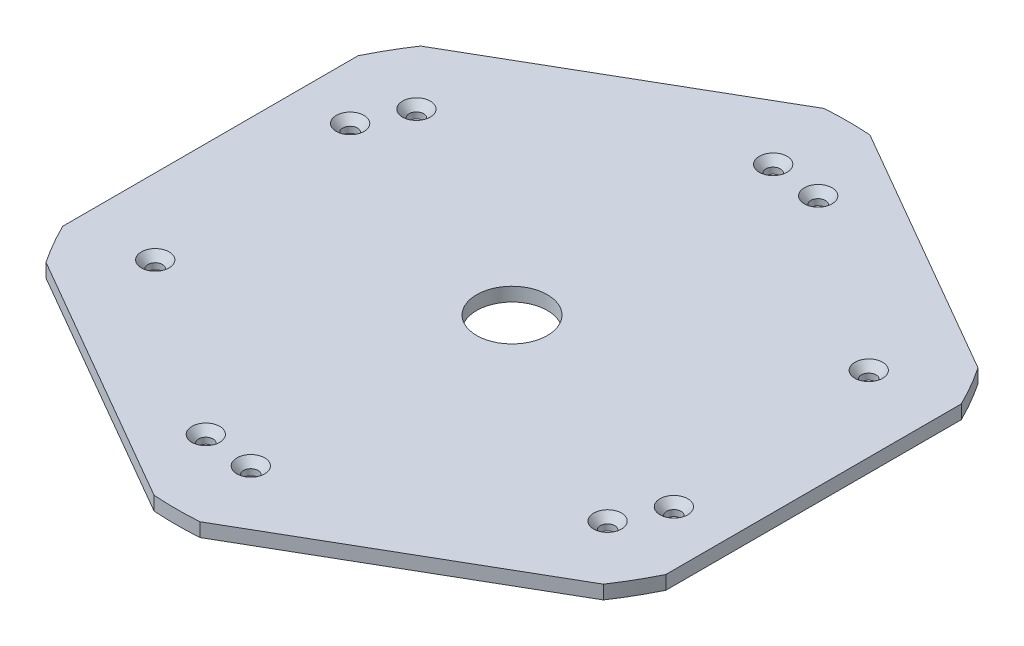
ISO-10303-21;
HEADER;
FILE_DESCRIPTION(('STEP AP214'),'2;1');
FILE_NAME('part.step','',(''),(''),'','','');
FILE_SCHEMA(('AUTOMOTIVE_DESIGN { 1 0 10303 214 1 1 1 1 }'));
ENDSEC;
DATA;
#1=APPLICATION_CONTEXT('core data for automotive mechanical design processes');
#2=APPLICATION_PROTOCOL_DEFINITION('international standard','automotive_design',2000,#1);
#3=PRODUCT_CONTEXT('',#1,'mechanical');
#4=PRODUCT('Part','Part','',(#3));
#5=PRODUCT_RELATED_PRODUCT_CATEGORY('part','',(#4));
#6=PRODUCT_DEFINITION_FORMATION('','',#4);
#7=PRODUCT_DEFINITION_CONTEXT('part definition',#1,'design');
#8=PRODUCT_DEFINITION('design','',#6,#7);
#9=PRODUCT_DEFINITION_SHAPE('','',#8);
#10=(LENGTH_UNIT() NAMED_UNIT(*) SI_UNIT(.MILLI.,.METRE.));
#11=(NAMED_UNIT(*) PLANE_ANGLE_UNIT() SI_UNIT($,.RADIAN.));
#12=(NAMED_UNIT(*) SI_UNIT($,.STERADIAN.) SOLID_ANGLE_UNIT());
#13=UNCERTAINTY_MEASURE_WITH_UNIT(LENGTH_MEASURE(1.E-05),#10,'distance_accuracy_value','');
#14=(GEOMETRIC_REPRESENTATION_CONTEXT(3) GLOBAL_UNCERTAINTY_ASSIGNED_CONTEXT((#13)) GLOBAL_UNIT_ASSIGNED_CONTEXT((#10,
#11,#12)) REPRESENTATION_CONTEXT('',''));
#15=CARTESIAN_POINT('',(0.,0.,0.));
#16=DIRECTION('',(0.,0.,1.));
#17=DIRECTION('',(1.,0.,0.));
#18=AXIS2_PLACEMENT_3D('',#15,#16,#17);
#19=CARTESIAN_POINT('',(0.,6.35,0.));
#20=DIRECTION('',(0.,-1.,0.));
#21=DIRECTION('',(0.,0.,-1.));
#22=AXIS2_PLACEMENT_3D('',#19,#20,#21);
#23=CYLINDRICAL_SURFACE('',#22,155.575);
#24=CARTESIAN_POINT('',(0.,6.35,0.));
#25=DIRECTION('',(0.,1.,0.));
#26=DIRECTION('',(0.,0.,1.));
#27=AXIS2_PLACEMENT_3D('',#24,#25,#26);
#28=CIRCLE('',#27,155.575);
#29=CARTESIAN_POINT('',(139.718923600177,6.35,-68.4266250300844));
#30=VERTEX_POINT('',#29);
#31=CARTESIAN_POINT('',(129.118657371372,6.35,-86.7868247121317));
#32=VERTEX_POINT('',#31);
#33=EDGE_CURVE('E347',#30,#32,#28,.T.);
#34=ORIENTED_EDGE('',*,*,#33,.F.);
#35=DIRECTION('',(0.,-1.,0.));
#36=VECTOR('',#35,1.);
#37=CARTESIAN_POINT('',(139.718923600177,6.35,-68.4266250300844));
#38=LINE('',#37,#36);
#39=CARTESIAN_POINT('',(139.718923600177,0.,-68.4266250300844));
#40=VERTEX_POINT('',#39);
#41=EDGE_CURVE('E247',#30,#40,#38,.T.);
#42=ORIENTED_EDGE('',*,*,#41,.T.);
#43=CARTESIAN_POINT('',(0.,0.,0.));
#44=DIRECTION('',(0.,1.,0.));
#45=DIRECTION('',(0.,0.,1.));
#46=AXIS2_PLACEMENT_3D('',#43,#44,#45);
#47=CIRCLE('',#46,155.575);
#48=CARTESIAN_POINT('',(129.118657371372,0.,-86.7868247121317));
#49=VERTEX_POINT('',#48);
#50=EDGE_CURVE('E193',#40,#49,#47,.T.);
#51=ORIENTED_EDGE('',*,*,#50,.T.);
#52=DIRECTION('',(0.,-1.,0.));
#53=VECTOR('',#52,1.);
#54=CARTESIAN_POINT('',(129.118657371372,6.35,-86.7868247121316));
#55=LINE('',#54,#53);
#56=EDGE_CURVE('E240',#49,#32,#55,.F.);
#57=ORIENTED_EDGE('',*,*,#56,.T.);
#58=EDGE_LOOP('',(#34,#42,#51,#57));
#59=FACE_BOUND('',#58,.T.);
#60=ADVANCED_FACE('F52',(#59),#23,.T.);
#61=CARTESIAN_POINT('',(10.6002662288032,6.35,-155.213449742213));
#62=VERTEX_POINT('',#61);
#63=CARTESIAN_POINT('',(-10.6002662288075,6.35,-155.213449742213));
#64=VERTEX_POINT('',#63);
#65=EDGE_CURVE('E244',#62,#64,#28,.T.);
#66=ORIENTED_EDGE('',*,*,#65,.F.);
#67=DIRECTION('',(0.,-1.,0.));
#68=VECTOR('',#67,1.);
#69=CARTESIAN_POINT('',(10.6002662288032,6.35,-155.213449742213));
#70=LINE('',#69,#68);
#71=CARTESIAN_POINT('',(10.6002662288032,0.,-155.213449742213));
#72=VERTEX_POINT('',#71);
#73=EDGE_CURVE('E238',#62,#72,#70,.T.);
#74=ORIENTED_EDGE('',*,*,#73,.T.);
#75=CARTESIAN_POINT('',(-10.6002662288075,0.,-155.213449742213));
#76=VERTEX_POINT('',#75);
#77=EDGE_CURVE('E204',#72,#76,#47,.T.);
#78=ORIENTED_EDGE('',*,*,#77,.T.);
#79=DIRECTION('',(0.,-1.,0.));
#80=VECTOR('',#79,1.);
#81=CARTESIAN_POINT('',(-10.6002662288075,6.35,-155.213449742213));
#82=LINE('',#81,#80);
#83=EDGE_CURVE('E376',#76,#64,#82,.F.);
#84=ORIENTED_EDGE('',*,*,#83,.T.);
#85=EDGE_LOOP('',(#66,#74,#78,#84));
#86=FACE_BOUND('',#85,.T.);
#87=ADVANCED_FACE('F242',(#86),#23,.T.);
#88=CARTESIAN_POINT('',(-129.118657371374,6.35,-86.7868247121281));
#89=VERTEX_POINT('',#88);
#90=CARTESIAN_POINT('',(-139.718923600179,6.35,-68.4266250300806));
#91=VERTEX_POINT('',#90);
#92=EDGE_CURVE('E353',#89,#91,#28,.T.);
#93=ORIENTED_EDGE('',*,*,#92,.F.);
#94=DIRECTION('',(0.,-1.,0.));
#95=VECTOR('',#94,1.);
#96=CARTESIAN_POINT('',(-129.118657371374,6.35,-86.7868247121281));
#97=LINE('',#96,#95);
#98=CARTESIAN_POINT('',(-129.118657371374,0.,-86.7868247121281));
#99=VERTEX_POINT('',#98);
#100=EDGE_CURVE('E223',#89,#99,#97,.T.);
#101=ORIENTED_EDGE('',*,*,#100,.T.);
#102=CARTESIAN_POINT('',(-139.718923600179,0.,-68.4266250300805));
#103=VERTEX_POINT('',#102);
#104=EDGE_CURVE('E186',#99,#103,#47,.T.);
#105=ORIENTED_EDGE('',*,*,#104,.T.);
#106=DIRECTION('',(0.,-1.,0.));
#107=VECTOR('',#106,1.);
#108=CARTESIAN_POINT('',(-139.718923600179,6.35,-68.4266250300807));
#109=LINE('',#108,#107);
#110=EDGE_CURVE('E79',#103,#91,#109,.F.);
#111=ORIENTED_EDGE('',*,*,#110,.T.);
#112=EDGE_LOOP('',(#93,#101,#105,#111));
#113=FACE_BOUND('',#112,.T.);
#114=ADVANCED_FACE('F221',(#113),#23,.T.);
#115=CARTESIAN_POINT('',(-139.718923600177,6.35,68.4266250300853));
#116=VERTEX_POINT('',#115);
#117=CARTESIAN_POINT('',(-129.118657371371,6.35,86.7868247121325));
#118=VERTEX_POINT('',#117);
#119=EDGE_CURVE('E200',#116,#118,#28,.T.);
#120=ORIENTED_EDGE('',*,*,#119,.F.);
#121=DIRECTION('',(0.,-1.,0.));
#122=VECTOR('',#121,1.);
#123=CARTESIAN_POINT('',(-139.718923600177,6.35,68.4266250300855));
#124=LINE('',#123,#122);
#125=CARTESIAN_POINT('',(-139.718923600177,0.,68.4266250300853));
#126=VERTEX_POINT('',#125);
#127=EDGE_CURVE('E366',#116,#126,#124,.T.);
#128=ORIENTED_EDGE('',*,*,#127,.T.);
#129=CARTESIAN_POINT('',(-129.118657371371,0.,86.7868247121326));
#130=VERTEX_POINT('',#129);
#131=EDGE_CURVE('E180',#126,#130,#47,.T.);
#132=ORIENTED_EDGE('',*,*,#131,.T.);
#133=DIRECTION('',(0.,-1.,0.));
#134=VECTOR('',#133,1.);
#135=CARTESIAN_POINT('',(-129.118657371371,6.35,86.7868247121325));
#136=LINE('',#135,#134);
#137=EDGE_CURVE('E68',#130,#118,#136,.F.);
#138=ORIENTED_EDGE('',*,*,#137,.T.);
#139=EDGE_LOOP('',(#120,#128,#132,#138));
#140=FACE_BOUND('',#139,.T.);
#141=ADVANCED_FACE('F365',(#140),#23,.T.);
#142=CARTESIAN_POINT('',(-10.6002662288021,6.35,155.213449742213));
#143=VERTEX_POINT('',#142);
#144=CARTESIAN_POINT('',(10.6002662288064,6.35,155.213449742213));
#145=VERTEX_POINT('',#144);
#146=EDGE_CURVE('E172',#143,#145,#28,.T.);
#147=ORIENTED_EDGE('',*,*,#146,.F.);
#148=DIRECTION('',(0.,-1.,0.));
#149=VECTOR('',#148,1.);
#150=CARTESIAN_POINT('',(-10.6002662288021,6.35,155.213449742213));
#151=LINE('',#150,#149);
#152=CARTESIAN_POINT('',(-10.6002662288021,0.,155.213449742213));
#153=VERTEX_POINT('',#152);
#154=EDGE_CURVE('E156',#143,#153,#151,.T.);
#155=ORIENTED_EDGE('',*,*,#154,.T.);
#156=CARTESIAN_POINT('',(10.6002662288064,0.,155.213449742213));
#157=VERTEX_POINT('',#156);
#158=EDGE_CURVE('E170',#153,#157,#47,.T.);
#159=ORIENTED_EDGE('',*,*,#158,.T.);
#160=DIRECTION('',(0.,-1.,0.));
#161=VECTOR('',#160,1.);
#162=CARTESIAN_POINT('',(10.6002662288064,6.35,155.213449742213));
#163=LINE('',#162,#161);
#164=EDGE_CURVE('E257',#157,#145,#163,.F.);
#165=ORIENTED_EDGE('',*,*,#164,.T.);
#166=EDGE_LOOP('',(#147,#155,#159,#165));
#167=FACE_BOUND('',#166,.T.);
#168=ADVANCED_FACE('F168',(#167),#23,.T.);
#169=CARTESIAN_POINT('',(129.118657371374,0.,86.7868247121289));
#170=VERTEX_POINT('',#169);
#171=CARTESIAN_POINT('',(139.718923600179,0.,68.4266250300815));
#172=VERTEX_POINT('',#171);
#173=EDGE_CURVE('E183',#170,#172,#47,.T.);
#174=ORIENTED_EDGE('',*,*,#173,.T.);
#175=DIRECTION('',(0.,-1.,0.));
#176=VECTOR('',#175,1.);
#177=CARTESIAN_POINT('',(139.718923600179,6.35,68.4266250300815));
#178=LINE('',#177,#176);
#179=CARTESIAN_POINT('',(139.718923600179,6.35,68.4266250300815));
#180=VERTEX_POINT('',#179);
#181=EDGE_CURVE('E245',#172,#180,#178,.F.);
#182=ORIENTED_EDGE('',*,*,#181,.T.);
#183=CARTESIAN_POINT('',(129.118657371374,6.35,86.7868247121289));
#184=VERTEX_POINT('',#183);
#185=EDGE_CURVE('E201',#184,#180,#28,.T.);
#186=ORIENTED_EDGE('',*,*,#185,.F.);
#187=DIRECTION('',(0.,-1.,0.));
#188=VECTOR('',#187,1.);
#189=CARTESIAN_POINT('',(129.118657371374,6.35,86.786824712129));
#190=LINE('',#189,#188);
#191=EDGE_CURVE('E259',#184,#170,#190,.T.);
#192=ORIENTED_EDGE('',*,*,#191,.T.);
#193=EDGE_LOOP('',(#174,#182,#186,#192));
#194=FACE_BOUND('',#193,.T.);
#195=ADVANCED_FACE('F54',(#194),#23,.T.);
#196=CARTESIAN_POINT('',(0.,6.35,0.));
#197=DIRECTION('',(0.,1.,0.));
#198=DIRECTION('',(0.,0.,1.));
#199=AXIS2_PLACEMENT_3D('',#196,#197,#198);
#200=PLANE('',#199);
#201=CARTESIAN_POINT('',(-23.0735883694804,6.35,118.785372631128));
#202=DIRECTION('',(0.,1.,0.));
#203=DIRECTION('',(0.,0.,1.));
#204=AXIS2_PLACEMENT_3D('',#201,#202,#203);
#205=CIRCLE('',#204,6.4389);
#206=CARTESIAN_POINT('',(-23.0735883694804,6.35,125.224272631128));
#207=VERTEX_POINT('',#206);
#208=EDGE_CURVE('E425',#207,#207,#205,.T.);
#209=ORIENTED_EDGE('',*,*,#208,.F.);
#210=EDGE_LOOP('',(#209));
#211=FACE_BOUND('',#210,.T.);
#212=CARTESIAN_POINT('',(-114.407944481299,6.35,-39.4103726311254));
#213=DIRECTION('',(0.,1.,0.));
#214=DIRECTION('',(0.,0.,1.));
#215=AXIS2_PLACEMENT_3D('',#212,#213,#214);
#216=CIRCLE('',#215,6.4389);
#217=CARTESIAN_POINT('',(-114.407944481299,6.35,-32.9714726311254));
#218=VERTEX_POINT('',#217);
#219=EDGE_CURVE('E414',#218,#218,#216,.T.);
#220=ORIENTED_EDGE('',*,*,#219,.F.);
#221=EDGE_LOOP('',(#220));
#222=FACE_BOUND('',#221,.T.);
#223=CARTESIAN_POINT('',(114.407944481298,6.35,39.4103726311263));
#224=DIRECTION('',(0.,1.,0.));
#225=DIRECTION('',(0.,0.,1.));
#226=AXIS2_PLACEMENT_3D('',#223,#224,#225);
#227=CIRCLE('',#226,6.4389);
#228=CARTESIAN_POINT('',(114.407944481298,6.35,45.8492726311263));
#229=VERTEX_POINT('',#228);
#230=EDGE_CURVE('E402',#229,#229,#227,.T.);
#231=ORIENTED_EDGE('',*,*,#230,.F.);
#232=EDGE_LOOP('',(#231));
#233=FACE_BOUND('',#232,.T.);
#234=CARTESIAN_POINT('',(23.0735883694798,6.35,-118.785372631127));
#235=DIRECTION('',(0.,1.,0.));
#236=DIRECTION('',(0.,0.,1.));
#237=AXIS2_PLACEMENT_3D('',#234,#235,#236);
#238=CIRCLE('',#237,6.4389);
#239=CARTESIAN_POINT('',(23.0735883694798,6.35,-112.346472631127));
#240=VERTEX_POINT('',#239);
#241=EDGE_CURVE('E391',#240,#240,#238,.T.);
#242=ORIENTED_EDGE('',*,*,#241,.F.);
#243=EDGE_LOOP('',(#242));
#244=FACE_BOUND('',#243,.T.);
#245=DIRECTION('',(0.,0.,1.));
#246=VECTOR('',#245,1.);
#247=CARTESIAN_POINT('',(139.718923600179,6.35,116.509208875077));
#248=LINE('',#247,#246);
#249=EDGE_CURVE('E367',#30,#180,#248,.T.);
#250=ORIENTED_EDGE('',*,*,#249,.F.);
#251=ORIENTED_EDGE('',*,*,#33,.T.);
#252=DIRECTION('',(0.866025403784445,0.,0.499999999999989));
#253=VECTOR('',#252,1.);
#254=CARTESIAN_POINT('',(170.759396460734,6.35,-62.7455327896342));
#255=LINE('',#254,#253);
#256=EDGE_CURVE('E370',#62,#32,#255,.T.);
#257=ORIENTED_EDGE('',*,*,#256,.F.);
#258=ORIENTED_EDGE('',*,*,#65,.T.);
#259=DIRECTION('',(0.866025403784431,0.,-0.500000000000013));
#260=VECTOR('',#259,1.);
#261=CARTESIAN_POINT('',(31.0404728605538,6.35,-179.254741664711));
#262=LINE('',#261,#260);
#263=EDGE_CURVE('E379',#89,#64,#262,.T.);
#264=ORIENTED_EDGE('',*,*,#263,.F.);
#265=ORIENTED_EDGE('',*,*,#92,.T.);
#266=DIRECTION('',(0.,0.,-1.));
#267=VECTOR('',#266,1.);
#268=CARTESIAN_POINT('',(-139.71892360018,6.35,-116.509208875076));
#269=LINE('',#268,#267);
#270=EDGE_CURVE('E363',#116,#91,#269,.T.);
#271=ORIENTED_EDGE('',*,*,#270,.F.);
#272=ORIENTED_EDGE('',*,*,#119,.T.);
#273=DIRECTION('',(-0.866025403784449,0.,-0.499999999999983));
#274=VECTOR('',#273,1.);
#275=CARTESIAN_POINT('',(-170.759396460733,6.35,62.7455327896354));
#276=LINE('',#275,#274);
#277=EDGE_CURVE('E362',#143,#118,#276,.T.);
#278=ORIENTED_EDGE('',*,*,#277,.F.);
#279=ORIENTED_EDGE('',*,*,#146,.T.);
#280=DIRECTION('',(-0.866025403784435,0.,0.500000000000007));
#281=VECTOR('',#280,1.);
#282=CARTESIAN_POINT('',(-31.0404728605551,6.35,179.254741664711));
#283=LINE('',#282,#281);
#284=EDGE_CURVE('E253',#184,#145,#283,.T.);
#285=ORIENTED_EDGE('',*,*,#284,.F.);
#286=ORIENTED_EDGE('',*,*,#185,.T.);
#287=EDGE_LOOP('',(#250,#251,#257,#258,#264,#265,#271,#272,#278,#279,#285,#286));
#288=FACE_BOUND('',#287,.T.);
#289=CARTESIAN_POINT('',(104.793923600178,6.35,-60.5028000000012));
#290=DIRECTION('',(0.,1.,0.));
#291=DIRECTION('',(0.,0.,1.));
#292=AXIS2_PLACEMENT_3D('',#289,#290,#291);
#293=CIRCLE('',#292,6.4389);
#294=CARTESIAN_POINT('',(104.793923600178,6.35,-54.0639000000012));
#295=VERTEX_POINT('',#294);
#296=EDGE_CURVE('E262',#295,#295,#293,.T.);
#297=ORIENTED_EDGE('',*,*,#296,.F.);
#298=EDGE_LOOP('',(#297));
#299=FACE_BOUND('',#298,.T.);
#300=CARTESIAN_POINT('',(104.793923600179,6.35,60.502799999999));
#301=DIRECTION('',(0.,1.,0.));
#302=DIRECTION('',(0.,0.,1.));
#303=AXIS2_PLACEMENT_3D('',#300,#301,#302);
#304=CIRCLE('',#303,6.4389);
#305=CARTESIAN_POINT('',(104.793923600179,6.35,66.941699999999));
#306=VERTEX_POINT('',#305);
#307=EDGE_CURVE('E274',#306,#306,#304,.T.);
#308=ORIENTED_EDGE('',*,*,#307,.F.);
#309=EDGE_LOOP('',(#308));
#310=FACE_BOUND('',#309,.T.);
#311=CARTESIAN_POINT('',(8.44978078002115E-13,6.35,121.0056));
#312=DIRECTION('',(0.,1.,0.));
#313=DIRECTION('',(0.,0.,1.));
#314=AXIS2_PLACEMENT_3D('',#311,#312,#313);
#315=CIRCLE('',#314,6.4389);
#316=CARTESIAN_POINT('',(8.44978078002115E-13,6.35,127.4445));
#317=VERTEX_POINT('',#316);
#318=EDGE_CURVE('E286',#317,#317,#315,.T.);
#319=ORIENTED_EDGE('',*,*,#318,.F.);
#320=EDGE_LOOP('',(#319));
#321=FACE_BOUND('',#320,.T.);
#322=CARTESIAN_POINT('',(-104.793923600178,6.35,60.5028000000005));
#323=DIRECTION('',(0.,1.,0.));
#324=DIRECTION('',(0.,0.,1.));
#325=AXIS2_PLACEMENT_3D('',#322,#323,#324);
#326=CIRCLE('',#325,6.4389);
#327=CARTESIAN_POINT('',(-104.793923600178,6.35,66.9417000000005));
#328=VERTEX_POINT('',#327);
#329=EDGE_CURVE('E297',#328,#328,#326,.T.);
#330=ORIENTED_EDGE('',*,*,#329,.F.);
#331=EDGE_LOOP('',(#330));
#332=FACE_BOUND('',#331,.T.);
#333=CARTESIAN_POINT('',(-104.793923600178,6.35,-60.5027999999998));
#334=DIRECTION('',(0.,1.,0.));
#335=DIRECTION('',(0.,0.,1.));
#336=AXIS2_PLACEMENT_3D('',#333,#334,#335);
#337=CIRCLE('',#336,6.4389);
#338=CARTESIAN_POINT('',(-104.793923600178,6.35,-54.0638999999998));
#339=VERTEX_POINT('',#338);
#340=EDGE_CURVE('E307',#339,#339,#337,.T.);
#341=ORIENTED_EDGE('',*,*,#340,.F.);
#342=EDGE_LOOP('',(#341));
#343=FACE_BOUND('',#342,.T.);
#344=CARTESIAN_POINT('',(0.,6.35,-121.0056));
#345=DIRECTION('',(0.,1.,0.));
#346=DIRECTION('',(0.,0.,1.));
#347=AXIS2_PLACEMENT_3D('',#344,#345,#346);
#348=CIRCLE('',#347,6.4389);
#349=CARTESIAN_POINT('',(0.,6.35,-114.5667));
#350=VERTEX_POINT('',#349);
#351=EDGE_CURVE('E316',#350,#350,#348,.T.);
#352=ORIENTED_EDGE('',*,*,#351,.F.);
#353=EDGE_LOOP('',(#352));
#354=FACE_BOUND('',#353,.T.);
#355=CARTESIAN_POINT('',(0.,6.35,0.));
#356=DIRECTION('',(0.,1.,0.));
#357=DIRECTION('',(0.,0.,1.));
#358=AXIS2_PLACEMENT_3D('',#355,#356,#357);
#359=CIRCLE('',#358,16.383);
#360=CARTESIAN_POINT('',(0.,6.35,16.383));
#361=VERTEX_POINT('',#360);
#362=EDGE_CURVE('E188',#361,#361,#359,.T.);
#363=ORIENTED_EDGE('',*,*,#362,.F.);
#364=EDGE_LOOP('',(#363));
#365=FACE_BOUND('',#364,.T.);
#366=ADVANCED_FACE('F330',(#211,#222,#233,#244,#288,#299,#310,#321,#332,#343,#354,#365),#200,.T.);
#367=CARTESIAN_POINT('',(0.,0.,0.));
#368=DIRECTION('',(0.,1.,0.));
#369=DIRECTION('',(0.,0.,1.));
#370=AXIS2_PLACEMENT_3D('',#367,#368,#369);
#371=PLANE('',#370);
#372=CARTESIAN_POINT('',(-23.0735883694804,0.,118.785372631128));
#373=DIRECTION('',(0.,1.,0.));
#374=DIRECTION('',(0.,0.,1.));
#375=AXIS2_PLACEMENT_3D('',#372,#373,#374);
#376=CIRCLE('',#375,3.37819999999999);
#377=CARTESIAN_POINT('',(-23.0735883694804,0.,122.163572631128));
#378=VERTEX_POINT('',#377);
#379=EDGE_CURVE('E417',#378,#378,#376,.T.);
#380=ORIENTED_EDGE('',*,*,#379,.T.);
#381=EDGE_LOOP('',(#380));
#382=FACE_BOUND('',#381,.T.);
#383=CARTESIAN_POINT('',(-114.407944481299,0.,-39.4103726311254));
#384=DIRECTION('',(0.,1.,0.));
#385=DIRECTION('',(0.,0.,1.));
#386=AXIS2_PLACEMENT_3D('',#383,#384,#385);
#387=CIRCLE('',#386,3.37819999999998);
#388=CARTESIAN_POINT('',(-114.407944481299,0.,-36.0321726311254));
#389=VERTEX_POINT('',#388);
#390=EDGE_CURVE('E406',#389,#389,#387,.T.);
#391=ORIENTED_EDGE('',*,*,#390,.T.);
#392=EDGE_LOOP('',(#391));
#393=FACE_BOUND('',#392,.T.);
#394=CARTESIAN_POINT('',(114.407944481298,0.,39.4103726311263));
#395=DIRECTION('',(0.,1.,0.));
#396=DIRECTION('',(0.,0.,1.));
#397=AXIS2_PLACEMENT_3D('',#394,#395,#396);
#398=CIRCLE('',#397,3.37819999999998);
#399=CARTESIAN_POINT('',(114.407944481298,0.,42.7885726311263));
#400=VERTEX_POINT('',#399);
#401=EDGE_CURVE('E394',#400,#400,#398,.T.);
#402=ORIENTED_EDGE('',*,*,#401,.T.);
#403=EDGE_LOOP('',(#402));
#404=FACE_BOUND('',#403,.T.);
#405=CARTESIAN_POINT('',(23.0735883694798,0.,-118.785372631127));
#406=DIRECTION('',(0.,1.,0.));
#407=DIRECTION('',(0.,0.,1.));
#408=AXIS2_PLACEMENT_3D('',#405,#406,#407);
#409=CIRCLE('',#408,3.37819999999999);
#410=CARTESIAN_POINT('',(23.0735883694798,0.,-115.407172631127));
#411=VERTEX_POINT('',#410);
#412=EDGE_CURVE('E385',#411,#411,#409,.T.);
#413=ORIENTED_EDGE('',*,*,#412,.T.);
#414=EDGE_LOOP('',(#413));
#415=FACE_BOUND('',#414,.T.);
#416=CARTESIAN_POINT('',(104.793923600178,0.,-60.5028000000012));
#417=DIRECTION('',(0.,1.,0.));
#418=DIRECTION('',(0.,0.,1.));
#419=AXIS2_PLACEMENT_3D('',#416,#417,#418);
#420=CIRCLE('',#419,3.3782);
#421=CARTESIAN_POINT('',(104.793923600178,0.,-57.1246000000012));
#422=VERTEX_POINT('',#421);
#423=EDGE_CURVE('E270',#422,#422,#420,.T.);
#424=ORIENTED_EDGE('',*,*,#423,.T.);
#425=EDGE_LOOP('',(#424));
#426=FACE_BOUND('',#425,.T.);
#427=CARTESIAN_POINT('',(104.793923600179,0.,60.502799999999));
#428=DIRECTION('',(0.,1.,0.));
#429=DIRECTION('',(0.,0.,1.));
#430=AXIS2_PLACEMENT_3D('',#427,#428,#429);
#431=CIRCLE('',#430,3.3782);
#432=CARTESIAN_POINT('',(104.793923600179,0.,63.880999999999));
#433=VERTEX_POINT('',#432);
#434=EDGE_CURVE('E282',#433,#433,#431,.T.);
#435=ORIENTED_EDGE('',*,*,#434,.T.);
#436=EDGE_LOOP('',(#435));
#437=FACE_BOUND('',#436,.T.);
#438=CARTESIAN_POINT('',(8.44978078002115E-13,0.,121.0056));
#439=DIRECTION('',(0.,1.,0.));
#440=DIRECTION('',(0.,0.,1.));
#441=AXIS2_PLACEMENT_3D('',#438,#439,#440);
#442=CIRCLE('',#441,3.3782);
#443=CARTESIAN_POINT('',(8.44978078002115E-13,0.,124.3838));
#444=VERTEX_POINT('',#443);
#445=EDGE_CURVE('E294',#444,#444,#442,.T.);
#446=ORIENTED_EDGE('',*,*,#445,.T.);
#447=EDGE_LOOP('',(#446));
#448=FACE_BOUND('',#447,.T.);
#449=CARTESIAN_POINT('',(-104.793923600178,0.,60.5028000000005));
#450=DIRECTION('',(0.,1.,0.));
#451=DIRECTION('',(0.,0.,1.));
#452=AXIS2_PLACEMENT_3D('',#449,#450,#451);
#453=CIRCLE('',#452,3.3782);
#454=CARTESIAN_POINT('',(-104.793923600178,0.,63.8810000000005));
#455=VERTEX_POINT('',#454);
#456=EDGE_CURVE('E303',#455,#455,#453,.T.);
#457=ORIENTED_EDGE('',*,*,#456,.T.);
#458=EDGE_LOOP('',(#457));
#459=FACE_BOUND('',#458,.T.);
#460=CARTESIAN_POINT('',(-104.793923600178,0.,-60.5027999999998));
#461=DIRECTION('',(0.,1.,0.));
#462=DIRECTION('',(0.,0.,1.));
#463=AXIS2_PLACEMENT_3D('',#460,#461,#462);
#464=CIRCLE('',#463,3.3782);
#465=CARTESIAN_POINT('',(-104.793923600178,0.,-57.1245999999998));
#466=VERTEX_POINT('',#465);
#467=EDGE_CURVE('E313',#466,#466,#464,.T.);
#468=ORIENTED_EDGE('',*,*,#467,.T.);
#469=EDGE_LOOP('',(#468));
#470=FACE_BOUND('',#469,.T.);
#471=CARTESIAN_POINT('',(0.,0.,-121.0056));
#472=DIRECTION('',(0.,1.,0.));
#473=DIRECTION('',(0.,0.,1.));
#474=AXIS2_PLACEMENT_3D('',#471,#472,#473);
#475=CIRCLE('',#474,3.3782);
#476=CARTESIAN_POINT('',(0.,0.,-117.6274));
#477=VERTEX_POINT('',#476);
#478=EDGE_CURVE('E322',#477,#477,#475,.T.);
#479=ORIENTED_EDGE('',*,*,#478,.T.);
#480=EDGE_LOOP('',(#479));
#481=FACE_BOUND('',#480,.T.);
#482=CARTESIAN_POINT('',(0.,0.,0.));
#483=DIRECTION('',(0.,1.,0.));
#484=DIRECTION('',(0.,0.,1.));
#485=AXIS2_PLACEMENT_3D('',#482,#483,#484);
#486=CIRCLE('',#485,16.383);
#487=CARTESIAN_POINT('',(0.,0.,16.383));
#488=VERTEX_POINT('',#487);
#489=EDGE_CURVE('E181',#488,#488,#486,.T.);
#490=ORIENTED_EDGE('',*,*,#489,.T.);
#491=EDGE_LOOP('',(#490));
#492=FACE_BOUND('',#491,.T.);
#493=ORIENTED_EDGE('',*,*,#50,.F.);
#494=DIRECTION('',(0.,0.,1.));
#495=VECTOR('',#494,1.);
#496=CARTESIAN_POINT('',(139.718923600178,0.,-1.45036420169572E-12));
#497=LINE('',#496,#495);
#498=EDGE_CURVE('E13',#40,#172,#497,.T.);
#499=ORIENTED_EDGE('',*,*,#498,.T.);
#500=ORIENTED_EDGE('',*,*,#173,.F.);
#501=DIRECTION('',(-0.866025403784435,0.,0.500000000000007));
#502=VECTOR('',#501,1.);
#503=CARTESIAN_POINT('',(69.8594618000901,0.,121.000137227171));
#504=LINE('',#503,#502);
#505=EDGE_CURVE('E164',#170,#157,#504,.T.);
#506=ORIENTED_EDGE('',*,*,#505,.T.);
#507=ORIENTED_EDGE('',*,*,#158,.F.);
#508=DIRECTION('',(-0.866025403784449,0.,-0.499999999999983));
#509=VECTOR('',#508,1.);
#510=CARTESIAN_POINT('',(-69.8594618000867,0.,121.000137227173));
#511=LINE('',#510,#509);
#512=EDGE_CURVE('E153',#153,#130,#511,.T.);
#513=ORIENTED_EDGE('',*,*,#512,.T.);
#514=ORIENTED_EDGE('',*,*,#131,.F.);
#515=DIRECTION('',(0.,0.,-1.));
#516=VECTOR('',#515,1.);
#517=CARTESIAN_POINT('',(-139.718923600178,0.,2.42761494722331E-12));
#518=LINE('',#517,#516);
#519=EDGE_CURVE('E163',#126,#103,#518,.T.);
#520=ORIENTED_EDGE('',*,*,#519,.T.);
#521=ORIENTED_EDGE('',*,*,#104,.F.);
#522=DIRECTION('',(0.866025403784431,0.,-0.500000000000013));
#523=VECTOR('',#522,1.);
#524=CARTESIAN_POINT('',(-69.8594618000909,0.,-121.00013722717));
#525=LINE('',#524,#523);
#526=EDGE_CURVE('E225',#99,#76,#525,.T.);
#527=ORIENTED_EDGE('',*,*,#526,.T.);
#528=ORIENTED_EDGE('',*,*,#77,.F.);
#529=DIRECTION('',(0.866025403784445,0.,0.499999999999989));
#530=VECTOR('',#529,1.);
#531=CARTESIAN_POINT('',(69.8594618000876,0.,-121.000137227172));
#532=LINE('',#531,#530);
#533=EDGE_CURVE('E61',#72,#49,#532,.T.);
#534=ORIENTED_EDGE('',*,*,#533,.T.);
#535=EDGE_LOOP('',(#493,#499,#500,#506,#507,#513,#514,#520,#521,#527,#528,#534));
#536=FACE_BOUND('',#535,.T.);
#537=ADVANCED_FACE('F177',(#382,#393,#404,#415,#426,#437,#448,#459,#470,#481,#492,#536),#371,.F.);
#538=CARTESIAN_POINT('',(0.,0.,0.));
#539=DIRECTION('',(0.,1.,0.));
#540=DIRECTION('',(0.,0.,1.));
#541=AXIS2_PLACEMENT_3D('',#538,#539,#540);
#542=CYLINDRICAL_SURFACE('',#541,16.383);
#543=ORIENTED_EDGE('',*,*,#489,.F.);
#544=EDGE_LOOP('',(#543));
#545=FACE_BOUND('',#544,.T.);
#546=ORIENTED_EDGE('',*,*,#362,.T.);
#547=EDGE_LOOP('',(#546));
#548=FACE_BOUND('',#547,.T.);
#549=ADVANCED_FACE('F328',(#545,#548),#542,.F.);
#550=CARTESIAN_POINT('',(0.,6.35,-121.0056));
#551=DIRECTION('',(0.,1.,0.));
#552=DIRECTION('',(0.,0.,1.));
#553=AXIS2_PLACEMENT_3D('',#550,#551,#552);
#554=CYLINDRICAL_SURFACE('',#553,3.3782);
#555=ORIENTED_EDGE('',*,*,#478,.F.);
#556=EDGE_LOOP('',(#555));
#557=FACE_BOUND('',#556,.T.);
#558=CARTESIAN_POINT('',(0.,2.82906741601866,-121.0056));
#559=DIRECTION('',(0.,1.,0.));
#560=DIRECTION('',(0.,0.,1.));
#561=AXIS2_PLACEMENT_3D('',#558,#559,#560);
#562=CIRCLE('',#561,3.3782);
#563=CARTESIAN_POINT('',(0.,2.82906741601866,-117.6274));
#564=VERTEX_POINT('',#563);
#565=EDGE_CURVE('E319',#564,#564,#562,.T.);
#566=ORIENTED_EDGE('',*,*,#565,.T.);
#567=EDGE_LOOP('',(#566));
#568=FACE_BOUND('',#567,.T.);
#569=ADVANCED_FACE('F525',(#557,#568),#554,.F.);
#570=CARTESIAN_POINT('',(0.,6.35,-121.0056));
#571=DIRECTION('',(0.,1.,0.));
#572=DIRECTION('',(0.,0.,1.));
#573=AXIS2_PLACEMENT_3D('',#570,#571,#572);
#574=CONICAL_SURFACE('',#573,6.4389,0.715584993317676);
#575=ORIENTED_EDGE('',*,*,#565,.F.);
#576=EDGE_LOOP('',(#575));
#577=FACE_BOUND('',#576,.T.);
#578=ORIENTED_EDGE('',*,*,#351,.T.);
#579=EDGE_LOOP('',(#578));
#580=FACE_BOUND('',#579,.T.);
#581=ADVANCED_FACE('F521',(#577,#580),#574,.F.);
#582=CARTESIAN_POINT('',(-104.793923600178,6.35,-60.5027999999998));
#583=DIRECTION('',(0.,1.,0.));
#584=DIRECTION('',(0.,0.,1.));
#585=AXIS2_PLACEMENT_3D('',#582,#583,#584);
#586=CYLINDRICAL_SURFACE('',#585,3.3782);
#587=ORIENTED_EDGE('',*,*,#467,.F.);
#588=EDGE_LOOP('',(#587));
#589=FACE_BOUND('',#588,.T.);
#590=CARTESIAN_POINT('',(-104.793923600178,2.82906741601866,-60.5027999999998));
#591=DIRECTION('',(0.,1.,0.));
#592=DIRECTION('',(0.,0.,1.));
#593=AXIS2_PLACEMENT_3D('',#590,#591,#592);
#594=CIRCLE('',#593,3.3782);
#595=CARTESIAN_POINT('',(-104.793923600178,2.82906741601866,-57.1245999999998));
#596=VERTEX_POINT('',#595);
#597=EDGE_CURVE('E310',#596,#596,#594,.T.);
#598=ORIENTED_EDGE('',*,*,#597,.T.);
#599=EDGE_LOOP('',(#598));
#600=FACE_BOUND('',#599,.T.);
#601=ADVANCED_FACE('F517',(#589,#600),#586,.F.);
#602=CARTESIAN_POINT('',(-104.793923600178,6.35,-60.5027999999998));
#603=DIRECTION('',(0.,1.,0.));
#604=DIRECTION('',(0.,0.,1.));
#605=AXIS2_PLACEMENT_3D('',#602,#603,#604);
#606=CONICAL_SURFACE('',#605,6.4389,0.715584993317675);
#607=ORIENTED_EDGE('',*,*,#597,.F.);
#608=EDGE_LOOP('',(#607));
#609=FACE_BOUND('',#608,.T.);
#610=ORIENTED_EDGE('',*,*,#340,.T.);
#611=EDGE_LOOP('',(#610));
#612=FACE_BOUND('',#611,.T.);
#613=ADVANCED_FACE('F513',(#609,#612),#606,.F.);
#614=CARTESIAN_POINT('',(-104.793923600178,6.35,60.5028000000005));
#615=DIRECTION('',(0.,1.,0.));
#616=DIRECTION('',(0.,0.,1.));
#617=AXIS2_PLACEMENT_3D('',#614,#615,#616);
#618=CYLINDRICAL_SURFACE('',#617,3.3782);
#619=ORIENTED_EDGE('',*,*,#456,.F.);
#620=EDGE_LOOP('',(#619));
#621=FACE_BOUND('',#620,.T.);
#622=CARTESIAN_POINT('',(-104.793923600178,2.82906741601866,60.5028000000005));
#623=DIRECTION('',(0.,1.,0.));
#624=DIRECTION('',(0.,0.,1.));
#625=AXIS2_PLACEMENT_3D('',#622,#623,#624);
#626=CIRCLE('',#625,3.3782);
#627=CARTESIAN_POINT('',(-104.793923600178,2.82906741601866,63.8810000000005));
#628=VERTEX_POINT('',#627);
#629=EDGE_CURVE('E300',#628,#628,#626,.T.);
#630=ORIENTED_EDGE('',*,*,#629,.T.);
#631=EDGE_LOOP('',(#630));
#632=FACE_BOUND('',#631,.T.);
#633=ADVANCED_FACE('F509',(#621,#632),#618,.F.);
#634=CARTESIAN_POINT('',(-104.793923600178,6.35,60.5028000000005));
#635=DIRECTION('',(0.,1.,0.));
#636=DIRECTION('',(0.,0.,1.));
#637=AXIS2_PLACEMENT_3D('',#634,#635,#636);
#638=CONICAL_SURFACE('',#637,6.4389,0.715584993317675);
#639=ORIENTED_EDGE('',*,*,#629,.F.);
#640=EDGE_LOOP('',(#639));
#641=FACE_BOUND('',#640,.T.);
#642=ORIENTED_EDGE('',*,*,#329,.T.);
#643=EDGE_LOOP('',(#642));
#644=FACE_BOUND('',#643,.T.);
#645=ADVANCED_FACE('F505',(#641,#644),#638,.F.);
#646=CARTESIAN_POINT('',(8.44978078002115E-13,6.35,121.0056));
#647=DIRECTION('',(0.,1.,0.));
#648=DIRECTION('',(0.,0.,1.));
#649=AXIS2_PLACEMENT_3D('',#646,#647,#648);
#650=CYLINDRICAL_SURFACE('',#649,3.3782);
#651=ORIENTED_EDGE('',*,*,#445,.F.);
#652=EDGE_LOOP('',(#651));
#653=FACE_BOUND('',#652,.T.);
#654=CARTESIAN_POINT('',(8.44978078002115E-13,2.82906741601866,121.0056));
#655=DIRECTION('',(0.,1.,0.));
#656=DIRECTION('',(0.,0.,1.));
#657=AXIS2_PLACEMENT_3D('',#654,#655,#656);
#658=CIRCLE('',#657,3.3782);
#659=CARTESIAN_POINT('',(8.44978078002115E-13,2.82906741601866,124.3838));
#660=VERTEX_POINT('',#659);
#661=EDGE_CURVE('E290',#660,#660,#658,.T.);
#662=ORIENTED_EDGE('',*,*,#661,.T.);
#663=EDGE_LOOP('',(#662));
#664=FACE_BOUND('',#663,.T.);
#665=ADVANCED_FACE('F501',(#653,#664),#650,.F.);
#666=CARTESIAN_POINT('',(8.44978078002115E-13,6.35,121.0056));
#667=DIRECTION('',(0.,1.,0.));
#668=DIRECTION('',(0.,0.,1.));
#669=AXIS2_PLACEMENT_3D('',#666,#667,#668);
#670=CONICAL_SURFACE('',#669,6.4389,0.715584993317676);
#671=ORIENTED_EDGE('',*,*,#661,.F.);
#672=EDGE_LOOP('',(#671));
#673=FACE_BOUND('',#672,.T.);
#674=ORIENTED_EDGE('',*,*,#318,.T.);
#675=EDGE_LOOP('',(#674));
#676=FACE_BOUND('',#675,.T.);
#677=ADVANCED_FACE('F497',(#673,#676),#670,.F.);
#678=CARTESIAN_POINT('',(104.793923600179,6.35,60.502799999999));
#679=DIRECTION('',(0.,1.,0.));
#680=DIRECTION('',(0.,0.,1.));
#681=AXIS2_PLACEMENT_3D('',#678,#679,#680);
#682=CYLINDRICAL_SURFACE('',#681,3.3782);
#683=ORIENTED_EDGE('',*,*,#434,.F.);
#684=EDGE_LOOP('',(#683));
#685=FACE_BOUND('',#684,.T.);
#686=CARTESIAN_POINT('',(104.793923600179,2.82906741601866,60.502799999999));
#687=DIRECTION('',(0.,1.,0.));
#688=DIRECTION('',(0.,0.,1.));
#689=AXIS2_PLACEMENT_3D('',#686,#687,#688);
#690=CIRCLE('',#689,3.3782);
#691=CARTESIAN_POINT('',(104.793923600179,2.82906741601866,63.880999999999));
#692=VERTEX_POINT('',#691);
#693=EDGE_CURVE('E278',#692,#692,#690,.T.);
#694=ORIENTED_EDGE('',*,*,#693,.T.);
#695=EDGE_LOOP('',(#694));
#696=FACE_BOUND('',#695,.T.);
#697=ADVANCED_FACE('F493',(#685,#696),#682,.F.);
#698=CARTESIAN_POINT('',(104.793923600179,6.35,60.502799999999));
#699=DIRECTION('',(0.,1.,0.));
#700=DIRECTION('',(0.,0.,1.));
#701=AXIS2_PLACEMENT_3D('',#698,#699,#700);
#702=CONICAL_SURFACE('',#701,6.4389,0.715584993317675);
#703=ORIENTED_EDGE('',*,*,#693,.F.);
#704=EDGE_LOOP('',(#703));
#705=FACE_BOUND('',#704,.T.);
#706=ORIENTED_EDGE('',*,*,#307,.T.);
#707=EDGE_LOOP('',(#706));
#708=FACE_BOUND('',#707,.T.);
#709=ADVANCED_FACE('F489',(#705,#708),#702,.F.);
#710=CARTESIAN_POINT('',(104.793923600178,6.35,-60.5028000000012));
#711=DIRECTION('',(0.,1.,0.));
#712=DIRECTION('',(0.,0.,1.));
#713=AXIS2_PLACEMENT_3D('',#710,#711,#712);
#714=CYLINDRICAL_SURFACE('',#713,3.3782);
#715=ORIENTED_EDGE('',*,*,#423,.F.);
#716=EDGE_LOOP('',(#715));
#717=FACE_BOUND('',#716,.T.);
#718=CARTESIAN_POINT('',(104.793923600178,2.82906741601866,-60.5028000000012));
#719=DIRECTION('',(0.,1.,0.));
#720=DIRECTION('',(0.,0.,1.));
#721=AXIS2_PLACEMENT_3D('',#718,#719,#720);
#722=CIRCLE('',#721,3.3782);
#723=CARTESIAN_POINT('',(104.793923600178,2.82906741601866,-57.1246000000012));
#724=VERTEX_POINT('',#723);
#725=EDGE_CURVE('E266',#724,#724,#722,.T.);
#726=ORIENTED_EDGE('',*,*,#725,.T.);
#727=EDGE_LOOP('',(#726));
#728=FACE_BOUND('',#727,.T.);
#729=ADVANCED_FACE('F485',(#717,#728),#714,.F.);
#730=CARTESIAN_POINT('',(104.793923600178,6.35,-60.5028000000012));
#731=DIRECTION('',(0.,1.,0.));
#732=DIRECTION('',(0.,0.,1.));
#733=AXIS2_PLACEMENT_3D('',#730,#731,#732);
#734=CONICAL_SURFACE('',#733,6.4389,0.715584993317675);
#735=ORIENTED_EDGE('',*,*,#725,.F.);
#736=EDGE_LOOP('',(#735));
#737=FACE_BOUND('',#736,.T.);
#738=ORIENTED_EDGE('',*,*,#296,.T.);
#739=EDGE_LOOP('',(#738));
#740=FACE_BOUND('',#739,.T.);
#741=ADVANCED_FACE('F481',(#737,#740),#734,.F.);
#742=CARTESIAN_POINT('',(-31.0404728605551,0.,179.254741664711));
#743=DIRECTION('',(-0.500000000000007,0.,-0.866025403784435));
#744=DIRECTION('',(-0.866025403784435,0.,0.500000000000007));
#745=AXIS2_PLACEMENT_3D('',#742,#743,#744);
#746=PLANE('',#745);
#747=ORIENTED_EDGE('',*,*,#284,.T.);
#748=ORIENTED_EDGE('',*,*,#164,.F.);
#749=ORIENTED_EDGE('',*,*,#505,.F.);
#750=ORIENTED_EDGE('',*,*,#191,.F.);
#751=EDGE_LOOP('',(#747,#748,#749,#750));
#752=FACE_BOUND('',#751,.T.);
#753=ADVANCED_FACE('F469',(#752),#746,.F.);
#754=CARTESIAN_POINT('',(-170.759396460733,0.,62.7455327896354));
#755=DIRECTION('',(0.499999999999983,0.,-0.866025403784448));
#756=DIRECTION('',(-0.866025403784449,0.,-0.499999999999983));
#757=AXIS2_PLACEMENT_3D('',#754,#755,#756);
#758=PLANE('',#757);
#759=ORIENTED_EDGE('',*,*,#277,.T.);
#760=ORIENTED_EDGE('',*,*,#137,.F.);
#761=ORIENTED_EDGE('',*,*,#512,.F.);
#762=ORIENTED_EDGE('',*,*,#154,.F.);
#763=EDGE_LOOP('',(#759,#760,#761,#762));
#764=FACE_BOUND('',#763,.T.);
#765=ADVANCED_FACE('F155',(#764),#758,.F.);
#766=CARTESIAN_POINT('',(-139.71892360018,0.,-116.509208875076));
#767=DIRECTION('',(1.,0.,0.));
#768=DIRECTION('',(0.,0.,-1.));
#769=AXIS2_PLACEMENT_3D('',#766,#767,#768);
#770=PLANE('',#769);
#771=ORIENTED_EDGE('',*,*,#270,.T.);
#772=ORIENTED_EDGE('',*,*,#110,.F.);
#773=ORIENTED_EDGE('',*,*,#519,.F.);
#774=ORIENTED_EDGE('',*,*,#127,.F.);
#775=EDGE_LOOP('',(#771,#772,#773,#774));
#776=FACE_BOUND('',#775,.T.);
#777=ADVANCED_FACE('F468',(#776),#770,.F.);
#778=CARTESIAN_POINT('',(31.0404728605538,0.,-179.254741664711));
#779=DIRECTION('',(0.500000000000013,0.,0.866025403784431));
#780=DIRECTION('',(0.866025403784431,0.,-0.500000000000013));
#781=AXIS2_PLACEMENT_3D('',#778,#779,#780);
#782=PLANE('',#781);
#783=ORIENTED_EDGE('',*,*,#263,.T.);
#784=ORIENTED_EDGE('',*,*,#83,.F.);
#785=ORIENTED_EDGE('',*,*,#526,.F.);
#786=ORIENTED_EDGE('',*,*,#100,.F.);
#787=EDGE_LOOP('',(#783,#784,#785,#786));
#788=FACE_BOUND('',#787,.T.);
#789=ADVANCED_FACE('F378',(#788),#782,.F.);
#790=CARTESIAN_POINT('',(170.759396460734,0.,-62.7455327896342));
#791=DIRECTION('',(-0.499999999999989,0.,0.866025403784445));
#792=DIRECTION('',(0.866025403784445,0.,0.499999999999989));
#793=AXIS2_PLACEMENT_3D('',#790,#791,#792);
#794=PLANE('',#793);
#795=ORIENTED_EDGE('',*,*,#256,.T.);
#796=ORIENTED_EDGE('',*,*,#56,.F.);
#797=ORIENTED_EDGE('',*,*,#533,.F.);
#798=ORIENTED_EDGE('',*,*,#73,.F.);
#799=EDGE_LOOP('',(#795,#796,#797,#798));
#800=FACE_BOUND('',#799,.T.);
#801=ADVANCED_FACE('F237',(#800),#794,.F.);
#802=CARTESIAN_POINT('',(139.718923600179,0.,116.509208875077));
#803=DIRECTION('',(-1.,0.,0.));
#804=DIRECTION('',(0.,0.,1.));
#805=AXIS2_PLACEMENT_3D('',#802,#803,#804);
#806=PLANE('',#805);
#807=ORIENTED_EDGE('',*,*,#249,.T.);
#808=ORIENTED_EDGE('',*,*,#181,.F.);
#809=ORIENTED_EDGE('',*,*,#498,.F.);
#810=ORIENTED_EDGE('',*,*,#41,.F.);
#811=EDGE_LOOP('',(#807,#808,#809,#810));
#812=FACE_BOUND('',#811,.T.);
#813=ADVANCED_FACE('F464',(#812),#806,.F.);
#814=CARTESIAN_POINT('',(23.0735883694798,6.35,-118.785372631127));
#815=DIRECTION('',(0.,1.,0.));
#816=DIRECTION('',(0.,0.,1.));
#817=AXIS2_PLACEMENT_3D('',#814,#815,#816);
#818=CYLINDRICAL_SURFACE('',#817,3.37819999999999);
#819=ORIENTED_EDGE('',*,*,#412,.F.);
#820=EDGE_LOOP('',(#819));
#821=FACE_BOUND('',#820,.T.);
#822=CARTESIAN_POINT('',(23.0735883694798,2.82906741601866,-118.785372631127));
#823=DIRECTION('',(0.,1.,0.));
#824=DIRECTION('',(0.,0.,1.));
#825=AXIS2_PLACEMENT_3D('',#822,#823,#824);
#826=CIRCLE('',#825,3.3782);
#827=CARTESIAN_POINT('',(23.0735883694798,2.82906741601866,-115.407172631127));
#828=VERTEX_POINT('',#827);
#829=EDGE_CURVE('E388',#828,#828,#826,.T.);
#830=ORIENTED_EDGE('',*,*,#829,.T.);
#831=EDGE_LOOP('',(#830));
#832=FACE_BOUND('',#831,.T.);
#833=ADVANCED_FACE('F460',(#821,#832),#818,.F.);
#834=CARTESIAN_POINT('',(23.0735883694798,6.35,-118.785372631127));
#835=DIRECTION('',(0.,1.,0.));
#836=DIRECTION('',(0.,0.,1.));
#837=AXIS2_PLACEMENT_3D('',#834,#835,#836);
#838=CONICAL_SURFACE('',#837,6.4389,0.715584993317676);
#839=ORIENTED_EDGE('',*,*,#829,.F.);
#840=EDGE_LOOP('',(#839));
#841=FACE_BOUND('',#840,.T.);
#842=ORIENTED_EDGE('',*,*,#241,.T.);
#843=EDGE_LOOP('',(#842));
#844=FACE_BOUND('',#843,.T.);
#845=ADVANCED_FACE('F456',(#841,#844),#838,.F.);
#846=CARTESIAN_POINT('',(114.407944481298,6.35,39.4103726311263));
#847=DIRECTION('',(0.,1.,0.));
#848=DIRECTION('',(0.,0.,1.));
#849=AXIS2_PLACEMENT_3D('',#846,#847,#848);
#850=CYLINDRICAL_SURFACE('',#849,3.37819999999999);
#851=ORIENTED_EDGE('',*,*,#401,.F.);
#852=EDGE_LOOP('',(#851));
#853=FACE_BOUND('',#852,.T.);
#854=CARTESIAN_POINT('',(114.407944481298,2.82906741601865,39.4103726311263));
#855=DIRECTION('',(0.,1.,0.));
#856=DIRECTION('',(0.,0.,1.));
#857=AXIS2_PLACEMENT_3D('',#854,#855,#856);
#858=CIRCLE('',#857,3.3782);
#859=CARTESIAN_POINT('',(114.407944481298,2.82906741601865,42.7885726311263));
#860=VERTEX_POINT('',#859);
#861=EDGE_CURVE('E398',#860,#860,#858,.T.);
#862=ORIENTED_EDGE('',*,*,#861,.T.);
#863=EDGE_LOOP('',(#862));
#864=FACE_BOUND('',#863,.T.);
#865=ADVANCED_FACE('F452',(#853,#864),#850,.F.);
#866=CARTESIAN_POINT('',(114.407944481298,6.35,39.4103726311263));
#867=DIRECTION('',(0.,1.,0.));
#868=DIRECTION('',(0.,0.,1.));
#869=AXIS2_PLACEMENT_3D('',#866,#867,#868);
#870=CONICAL_SURFACE('',#869,6.4389,0.715584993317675);
#871=ORIENTED_EDGE('',*,*,#861,.F.);
#872=EDGE_LOOP('',(#871));
#873=FACE_BOUND('',#872,.T.);
#874=ORIENTED_EDGE('',*,*,#230,.T.);
#875=EDGE_LOOP('',(#874));
#876=FACE_BOUND('',#875,.T.);
#877=ADVANCED_FACE('F448',(#873,#876),#870,.F.);
#878=CARTESIAN_POINT('',(-114.407944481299,6.35,-39.4103726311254));
#879=DIRECTION('',(0.,1.,0.));
#880=DIRECTION('',(0.,0.,1.));
#881=AXIS2_PLACEMENT_3D('',#878,#879,#880);
#882=CYLINDRICAL_SURFACE('',#881,3.37819999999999);
#883=ORIENTED_EDGE('',*,*,#390,.F.);
#884=EDGE_LOOP('',(#883));
#885=FACE_BOUND('',#884,.T.);
#886=CARTESIAN_POINT('',(-114.407944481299,2.82906741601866,-39.4103726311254));
#887=DIRECTION('',(0.,1.,0.));
#888=DIRECTION('',(0.,0.,1.));
#889=AXIS2_PLACEMENT_3D('',#886,#887,#888);
#890=CIRCLE('',#889,3.3782);
#891=CARTESIAN_POINT('',(-114.407944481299,2.82906741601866,-36.0321726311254));
#892=VERTEX_POINT('',#891);
#893=EDGE_CURVE('E410',#892,#892,#890,.T.);
#894=ORIENTED_EDGE('',*,*,#893,.T.);
#895=EDGE_LOOP('',(#894));
#896=FACE_BOUND('',#895,.T.);
#897=ADVANCED_FACE('F444',(#885,#896),#882,.F.);
#898=CARTESIAN_POINT('',(-114.407944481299,6.35,-39.4103726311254));
#899=DIRECTION('',(0.,1.,0.));
#900=DIRECTION('',(0.,0.,1.));
#901=AXIS2_PLACEMENT_3D('',#898,#899,#900);
#902=CONICAL_SURFACE('',#901,6.4389,0.715584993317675);
#903=ORIENTED_EDGE('',*,*,#893,.F.);
#904=EDGE_LOOP('',(#903));
#905=FACE_BOUND('',#904,.T.);
#906=ORIENTED_EDGE('',*,*,#219,.T.);
#907=EDGE_LOOP('',(#906));
#908=FACE_BOUND('',#907,.T.);
#909=ADVANCED_FACE('F437',(#905,#908),#902,.F.);
#910=CARTESIAN_POINT('',(-23.0735883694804,6.35,118.785372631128));
#911=DIRECTION('',(0.,1.,0.));
#912=DIRECTION('',(0.,0.,1.));
#913=AXIS2_PLACEMENT_3D('',#910,#911,#912);
#914=CYLINDRICAL_SURFACE('',#913,3.37819999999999);
#915=ORIENTED_EDGE('',*,*,#379,.F.);
#916=EDGE_LOOP('',(#915));
#917=FACE_BOUND('',#916,.T.);
#918=CARTESIAN_POINT('',(-23.0735883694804,2.82906741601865,118.785372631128));
#919=DIRECTION('',(0.,1.,0.));
#920=DIRECTION('',(0.,0.,1.));
#921=AXIS2_PLACEMENT_3D('',#918,#919,#920);
#922=CIRCLE('',#921,3.3782);
#923=CARTESIAN_POINT('',(-23.0735883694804,2.82906741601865,122.163572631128));
#924=VERTEX_POINT('',#923);
#925=EDGE_CURVE('E421',#924,#924,#922,.T.);
#926=ORIENTED_EDGE('',*,*,#925,.T.);
#927=EDGE_LOOP('',(#926));
#928=FACE_BOUND('',#927,.T.);
#929=ADVANCED_FACE('F431',(#917,#928),#914,.F.);
#930=CARTESIAN_POINT('',(-23.0735883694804,6.35,118.785372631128));
#931=DIRECTION('',(0.,1.,0.));
#932=DIRECTION('',(0.,0.,1.));
#933=AXIS2_PLACEMENT_3D('',#930,#931,#932);
#934=CONICAL_SURFACE('',#933,6.4389,0.715584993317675);
#935=ORIENTED_EDGE('',*,*,#925,.F.);
#936=EDGE_LOOP('',(#935));
#937=FACE_BOUND('',#936,.T.);
#938=ORIENTED_EDGE('',*,*,#208,.T.);
#939=EDGE_LOOP('',(#938));
#940=FACE_BOUND('',#939,.T.);
#941=ADVANCED_FACE('F429',(#937,#940),#934,.F.);
#942=CLOSED_SHELL('',(#60,#87,#114,#141,#168,#195,#366,#537,#549,#569,#581,#601,#613,#633,#645,
#665,#677,#697,#709,#729,#741,#753,#765,#777,#789,#801,#813,#833,#845,#865,#877,#897,#909,#929,#941));
#943=MANIFOLD_SOLID_BREP('B2',#942);
#944=ADVANCED_BREP_SHAPE_REPRESENTATION('',(#18,#943),#14);
#945=SHAPE_DEFINITION_REPRESENTATION(#9,#944);
ENDSEC;
END-ISO-10303-21;
